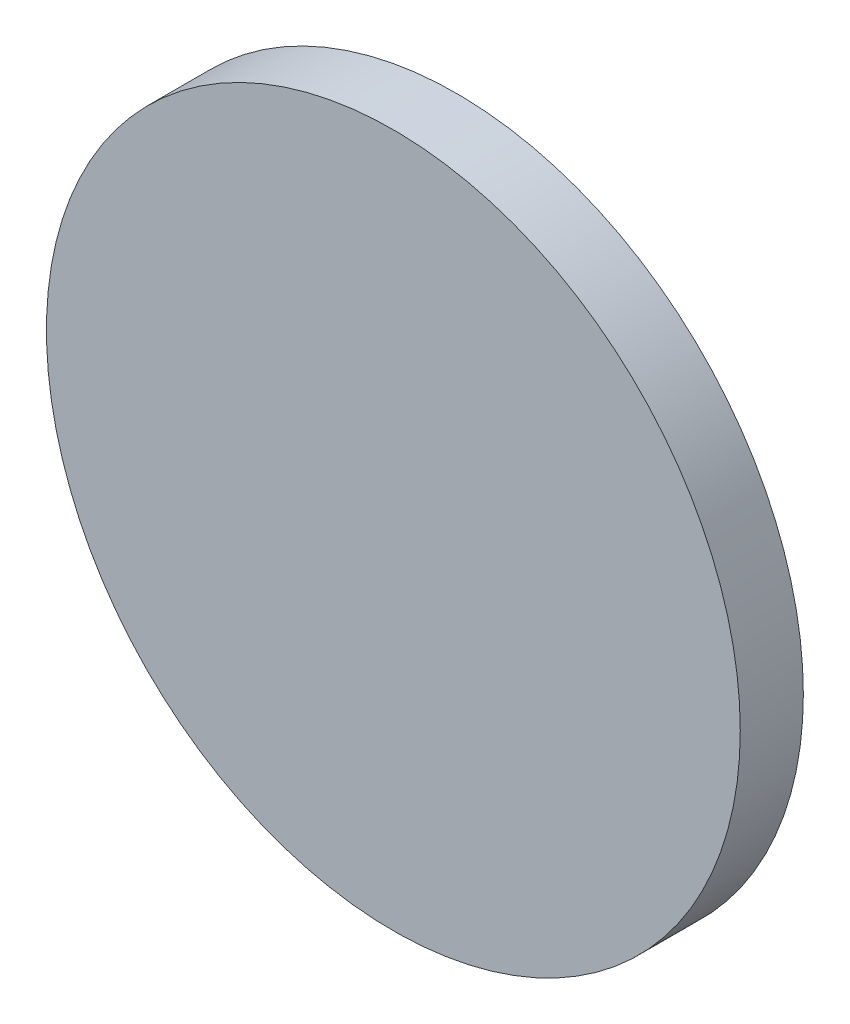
from build123d import *

# Parameters (mm, degrees)
SKETCH1_R           = 5
BOSS_EXTRUDE1_DEPTH = 12
SKETCH2_R           = 55
BOSS_EXTRUDE2_DEPTH = 10


with BuildPart() as part:
    # Sketch1 → Boss-Extrude1 (new body)
    with BuildSketch(Plane.XY):
        Circle(SKETCH1_R)
    extrude(amount=BOSS_EXTRUDE1_DEPTH)

    # Sketch2 → Boss-Extrude2 (add)
    with BuildSketch(Plane.XY.offset(12)):
        Circle(SKETCH2_R)
    extrude(amount=BOSS_EXTRUDE2_DEPTH)


solid = part.part
